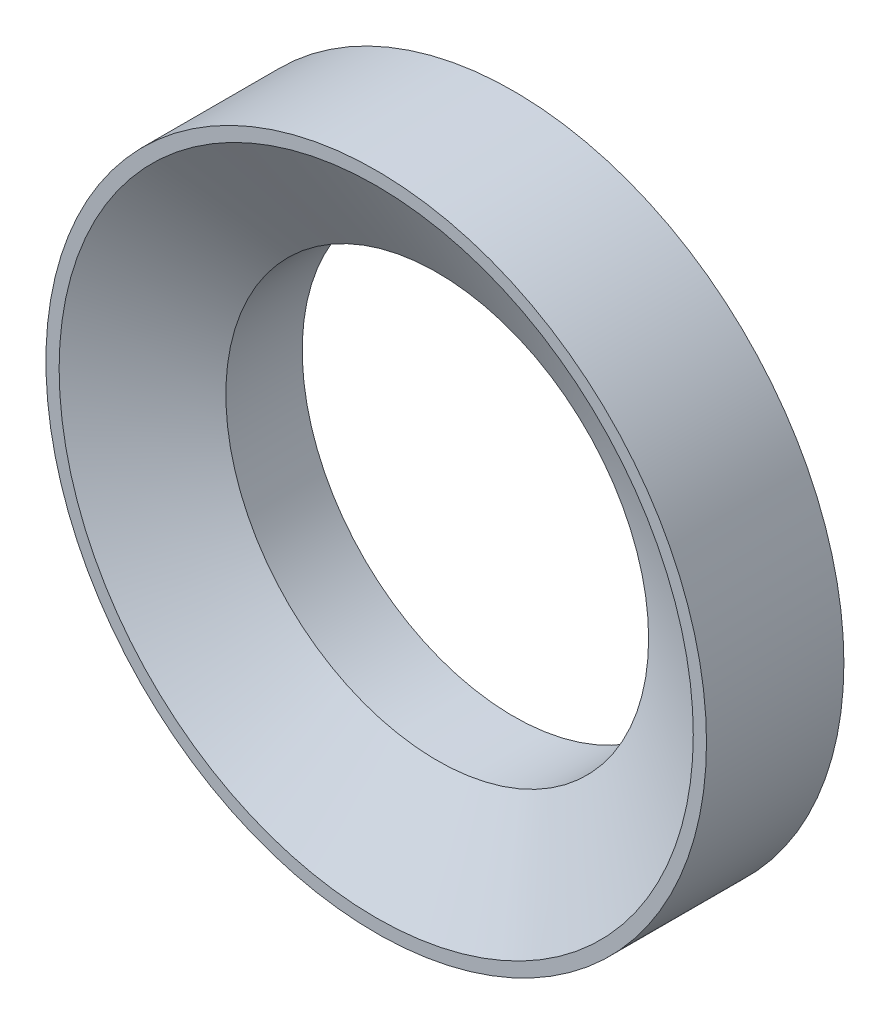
from build123d import *


with BuildPart() as part:
    # Sketch1 → Base-Revolve (revolve)
    with BuildSketch(Plane(origin=(0, 0, 0), x_dir=(0, -1, 0), z_dir=(-1, 0, 0)), mode=Mode.PRIVATE) as base_revolve_sk:
        Polygon((-4, -2.6), (-6.25, -2.6), (-6.25, 0), (-6, 0), (-4, -1.154700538), align=None)
    revolve(base_revolve_sk.sketch.rotate(Axis((0, 0, 12.948493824), (0, 0, -1)), 90), axis=Axis((0, 0, 12.948493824), (0, 0, -1)))


solid = part.part
